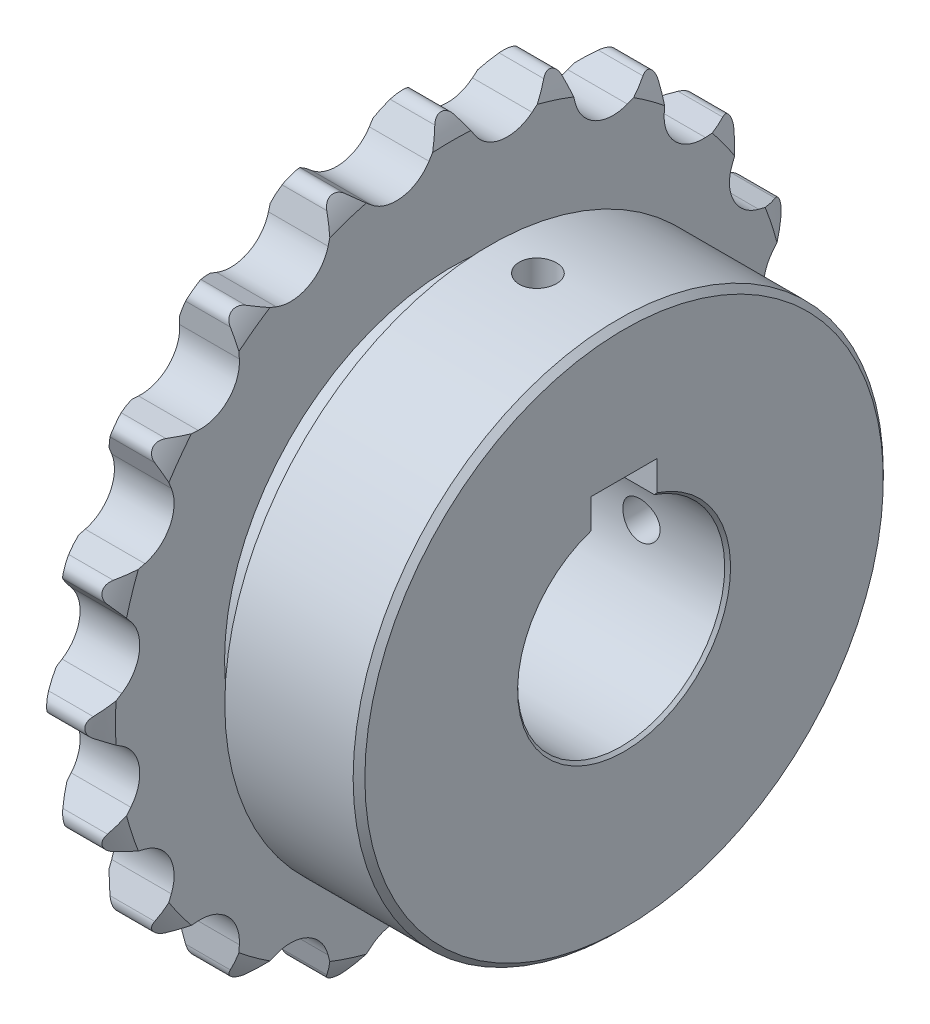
from build123d import *

# Parameters (mm, degrees)
SKIZZE2_R                       = 51.6
SCHNITT_LINEAR_AUSTRAGEN1_DEPTH = 7.2
SCHNITT_LINEAR_AUSTRAGEN2_DEPTH = 28
SKIZZE4_W                       = 2.25
SKIZZE4_H                       = 16.2
SKIZZE5_W                       = 2.25
SKIZZE5_H                       = 19.75


with BuildPart() as part:
    # Skizze1 → Rotation1 (revolve)
    with BuildSketch(Plane.XY, mode=Mode.PRIVATE) as rotation1_sk:
        with BuildLine():
            Line((0, 40.595), (0, 12.853553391))
            Line((0, 12.853553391), (0.353553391, 12.5))
            Line((0.353553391, 12.5), (27.646446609, 12.5))
            Line((27.646446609, 12.5), (28, 12.853553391))
            Line((28, 12.853553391), (28, 31.292893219))
            Line((28, 31.292893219), (27.292893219, 32))
            Line((27.292893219, 32), (11.8, 32))
            Line((11.8, 32), (11.8, 27.428571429))
            Line((11.8, 27.428571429), (7.2, 27.428571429))
            Line((7.2, 27.428571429), (7.2, 40.595))
            ThreePointArc((7.2, 40.595), (6.613396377, 41.831768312), (5.9, 43))
            Line((5.9, 43), (1.3, 43))
            ThreePointArc((1.3, 43), (0.586603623, 41.831768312), (0, 40.595))
        make_face()
    revolve(rotation1_sk.sketch.rotate(Axis((28, 0, 0), (-1, 0, 0)), 270), axis=Axis((28, 0, 0), (-1, 0, 0)))

    # Skizze2 → Schnitt-Linear austragen1 (cut)
    with BuildSketch(Plane(origin=(0, 0, 0), x_dir=(0, 0, -1), z_dir=(1, 0, 0))):
        Circle(SKIZZE2_R)
        with BuildLine():
            Line((-42.369627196, -1.145800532), (-39.839775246, -2.749089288))
            ThreePointArc((-39.839775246, -2.749089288), (-38.432356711, -4.13328118), (-37.719817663, -5.974232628))
            ThreePointArc((-37.719817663, -5.974232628), (-37.828597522, -7.945267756), (-38.739393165, -9.696628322))
            Line((-38.739393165, -9.696628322), (-40.649981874, -12.003213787))
            ThreePointArc((-40.649981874, -12.003213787), (-40.895430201, -13.287730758), (-39.941838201, -14.182655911))
            Line((-39.941838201, -14.182655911), (-37.040362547, -14.925706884))
            ThreePointArc((-37.040362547, -14.925706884), (-35.274089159, -15.807235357), (-34.027538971, -17.337897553))
            ThreePointArc((-34.027538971, -17.337897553), (-33.521911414, -19.246078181), (-33.846929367, -21.193172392))
            Line((-33.846929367, -21.193172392), (-34.951233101, -23.977269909))
            ThreePointArc((-34.951233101, -23.977269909), (-34.787730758, -25.274765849), (-33.604263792, -25.831214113))
            Line((-33.604263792, -25.831214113), (-30.615181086, -25.641292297))
            ThreePointArc((-30.615181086, -25.641292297), (-28.662947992, -25.933867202), (-27.004407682, -27.004408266))
            ThreePointArc((-27.004407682, -27.004408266), (-25.933867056, -28.662948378), (-25.641292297, -30.615181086))
            Line((-25.641292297, -30.615181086), (-25.831214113, -33.604263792))
            ThreePointArc((-25.831214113, -33.604263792), (-25.274765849, -34.787730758), (-23.977269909, -34.951233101))
            Line((-23.977269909, -34.951233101), (-21.193172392, -33.846929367))
            ThreePointArc((-21.193172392, -33.846929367), (-19.246077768, -33.521911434), (-17.337896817, -34.027539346))
            ThreePointArc((-17.337896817, -34.027539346), (-15.807235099, -35.274089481), (-14.925706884, -37.040362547))
            Line((-14.925706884, -37.040362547), (-14.182655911, -39.941838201))
            ThreePointArc((-14.182655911, -39.941838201), (-13.287730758, -40.895430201), (-12.003213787, -40.649981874))
            Line((-12.003213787, -40.649981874), (-9.696628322, -38.739393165))
            ThreePointArc((-9.696628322, -38.739393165), (-7.945267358, -37.828597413), (-5.974231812, -37.719817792))
            ThreePointArc((-5.974231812, -37.719817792), (-4.133280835, -38.432356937), (-2.749089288, -39.839775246))
            Line((-2.749089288, -39.839775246), (-1.145800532, -42.369627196))
            ThreePointArc((-1.145800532, -42.369627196), (0, -43), (1.145800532, -42.369627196))
            Line((1.145800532, -42.369627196), (2.749089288, -39.839775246))
            ThreePointArc((2.749089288, -39.839775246), (4.13328118, -38.432356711), (5.974232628, -37.719817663))
            ThreePointArc((5.974232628, -37.719817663), (7.945267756, -37.828597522), (9.696628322, -38.739393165))
            Line((9.696628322, -38.739393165), (12.003213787, -40.649981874))
            ThreePointArc((12.003213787, -40.649981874), (13.287730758, -40.895430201), (14.182655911, -39.941838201))
            Line((14.182655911, -39.941838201), (14.925706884, -37.040362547))
            ThreePointArc((14.925706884, -37.040362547), (15.807235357, -35.274089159), (17.337897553, -34.027538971))
            ThreePointArc((17.337897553, -34.027538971), (19.246078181, -33.521911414), (21.193172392, -33.846929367))
            Line((21.193172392, -33.846929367), (23.977269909, -34.951233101))
            ThreePointArc((23.977269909, -34.951233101), (25.274765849, -34.787730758), (25.831214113, -33.604263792))
            Line((25.831214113, -33.604263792), (25.641292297, -30.615181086))
            ThreePointArc((25.641292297, -30.615181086), (25.933867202, -28.662947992), (27.004408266, -27.004407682))
            ThreePointArc((27.004408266, -27.004407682), (28.662948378, -25.933867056), (30.615181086, -25.641292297))
            Line((30.615181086, -25.641292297), (33.604263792, -25.831214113))
            ThreePointArc((33.604263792, -25.831214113), (34.787730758, -25.274765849), (34.951233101, -23.977269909))
            Line((34.951233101, -23.977269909), (33.846929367, -21.193172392))
            ThreePointArc((33.846929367, -21.193172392), (33.521911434, -19.246077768), (34.027539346, -17.337896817))
            ThreePointArc((34.027539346, -17.337896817), (35.274089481, -15.807235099), (37.040362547, -14.925706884))
            Line((37.040362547, -14.925706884), (39.941838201, -14.182655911))
            ThreePointArc((39.941838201, -14.182655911), (40.895430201, -13.287730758), (40.649981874, -12.003213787))
            Line((40.649981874, -12.003213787), (38.739393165, -9.696628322))
            ThreePointArc((38.739393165, -9.696628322), (37.828597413, -7.945267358), (37.719817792, -5.974231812))
            ThreePointArc((37.719817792, -5.974231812), (38.432356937, -4.133280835), (39.839775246, -2.749089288))
            Line((39.839775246, -2.749089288), (42.369627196, -1.145800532))
            ThreePointArc((42.369627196, -1.145800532), (43, 0), (42.369627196, 1.145800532))
            Line((42.369627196, 1.145800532), (39.839775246, 2.749089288))
            ThreePointArc((39.839775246, 2.749089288), (38.432356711, 4.13328118), (37.719817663, 5.974232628))
            ThreePointArc((37.719817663, 5.974232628), (37.828597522, 7.945267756), (38.739393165, 9.696628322))
            Line((38.739393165, 9.696628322), (40.649981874, 12.003213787))
            ThreePointArc((40.649981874, 12.003213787), (40.895430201, 13.287730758), (39.941838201, 14.182655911))
            Line((39.941838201, 14.182655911), (37.040362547, 14.925706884))
            ThreePointArc((37.040362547, 14.925706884), (35.274089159, 15.807235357), (34.027538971, 17.337897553))
            ThreePointArc((34.027538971, 17.337897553), (33.521911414, 19.246078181), (33.846929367, 21.193172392))
            Line((33.846929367, 21.193172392), (34.951233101, 23.977269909))
            ThreePointArc((34.951233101, 23.977269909), (34.787730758, 25.274765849), (33.604263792, 25.831214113))
            Line((33.604263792, 25.831214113), (30.615181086, 25.641292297))
            ThreePointArc((30.615181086, 25.641292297), (28.662947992, 25.933867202), (27.004407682, 27.004408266))
            ThreePointArc((27.004407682, 27.004408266), (25.933867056, 28.662948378), (25.641292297, 30.615181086))
            Line((25.641292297, 30.615181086), (25.831214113, 33.604263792))
            ThreePointArc((25.831214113, 33.604263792), (25.274765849, 34.787730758), (23.977269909, 34.951233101))
            Line((23.977269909, 34.951233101), (21.193172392, 33.846929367))
            ThreePointArc((21.193172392, 33.846929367), (19.246077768, 33.521911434), (17.337896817, 34.027539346))
            ThreePointArc((17.337896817, 34.027539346), (15.807235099, 35.274089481), (14.925706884, 37.040362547))
            Line((14.925706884, 37.040362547), (14.182655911, 39.941838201))
            ThreePointArc((14.182655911, 39.941838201), (13.287730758, 40.895430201), (12.003213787, 40.649981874))
            Line((12.003213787, 40.649981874), (9.696628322, 38.739393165))
            ThreePointArc((9.696628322, 38.739393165), (7.945267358, 37.828597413), (5.974231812, 37.719817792))
            ThreePointArc((5.974231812, 37.719817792), (4.133280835, 38.432356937), (2.749089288, 39.839775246))
            Line((2.749089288, 39.839775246), (1.145800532, 42.369627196))
            ThreePointArc((1.145800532, 42.369627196), (0, 43), (-1.145800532, 42.369627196))
            Line((-1.145800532, 42.369627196), (-2.749089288, 39.839775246))
            ThreePointArc((-2.749089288, 39.839775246), (-4.13328118, 38.432356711), (-5.974232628, 37.719817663))
            ThreePointArc((-5.974232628, 37.719817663), (-7.945267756, 37.828597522), (-9.696628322, 38.739393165))
            Line((-9.696628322, 38.739393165), (-12.003213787, 40.649981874))
            ThreePointArc((-12.003213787, 40.649981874), (-13.287730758, 40.895430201), (-14.182655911, 39.941838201))
            Line((-14.182655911, 39.941838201), (-14.925706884, 37.040362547))
            ThreePointArc((-14.925706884, 37.040362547), (-15.807235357, 35.274089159), (-17.337897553, 34.027538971))
            ThreePointArc((-17.337897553, 34.027538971), (-19.246078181, 33.521911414), (-21.193172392, 33.846929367))
            Line((-21.193172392, 33.846929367), (-23.977269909, 34.951233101))
            ThreePointArc((-23.977269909, 34.951233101), (-25.274765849, 34.787730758), (-25.831214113, 33.604263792))
            Line((-25.831214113, 33.604263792), (-25.641292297, 30.615181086))
            ThreePointArc((-25.641292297, 30.615181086), (-25.933867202, 28.662947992), (-27.004408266, 27.004407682))
            ThreePointArc((-27.004408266, 27.004407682), (-28.662948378, 25.933867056), (-30.615181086, 25.641292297))
            Line((-30.615181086, 25.641292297), (-33.604263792, 25.831214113))
            ThreePointArc((-33.604263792, 25.831214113), (-34.787730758, 25.274765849), (-34.951233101, 23.977269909))
            Line((-34.951233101, 23.977269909), (-33.846929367, 21.193172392))
            ThreePointArc((-33.846929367, 21.193172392), (-33.521911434, 19.246077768), (-34.027539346, 17.337896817))
            ThreePointArc((-34.027539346, 17.337896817), (-35.274089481, 15.807235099), (-37.040362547, 14.925706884))
            Line((-37.040362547, 14.925706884), (-39.941838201, 14.182655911))
            ThreePointArc((-39.941838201, 14.182655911), (-40.895430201, 13.287730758), (-40.649981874, 12.003213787))
            Line((-40.649981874, 12.003213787), (-38.739393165, 9.696628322))
            ThreePointArc((-38.739393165, 9.696628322), (-37.828597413, 7.945267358), (-37.719817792, 5.974231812))
            ThreePointArc((-37.719817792, 5.974231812), (-38.432356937, 4.133280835), (-39.839775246, 2.749089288))
            Line((-39.839775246, 2.749089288), (-42.369627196, 1.145800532))
            ThreePointArc((-42.369627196, 1.145800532), (-43, 0), (-42.369627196, -1.145800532))
        make_face(mode=Mode.SUBTRACT)
    extrude(amount=SCHNITT_LINEAR_AUSTRAGEN1_DEPTH, mode=Mode.SUBTRACT)

    # Skizze3 → Schnitt-Linear austragen2 (cut)
    with BuildSketch(Plane(origin=(28, 0, 0), x_dir=(0, 0, -1), z_dir=(1, 0, 0))):
        with BuildLine():
            Line((4, 11.842719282), (4, 15.8))
            Line((4, 15.8), (-4, 15.8))
            Line((-4, 15.8), (-4, 11.842719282))
            ThreePointArc((-4, 11.842719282), (0, -12.5), (4, 11.842719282))
        make_face()
    extrude(amount=-SCHNITT_LINEAR_AUSTRAGEN2_DEPTH, mode=Mode.SUBTRACT)

    # Skizze4 → Schnitt-Rotation1 (revolve, cut)
    with BuildSketch(Plane.XY, mode=Mode.PRIVATE) as schnitt_rotation1_sk:
        with Locations((18.725, 23.9)):
            Rectangle(SKIZZE4_W, SKIZZE4_H)
    revolve(schnitt_rotation1_sk.sketch.rotate(Axis((17.6, 15.8, 0), (0, 1, 0)), 270), axis=Axis((17.6, 15.8, 0), (0, 1, 0)), mode=Mode.SUBTRACT)

    # Skizze5 → Schnitt-Rotation2 (revolve, cut)
    with BuildSketch(Plane(origin=(0, 0, 0), x_dir=(-1, 0, 0), z_dir=(0, 1, 0)), mode=Mode.PRIVATE) as schnitt_rotation2_sk:
        with Locations((-18.725, -22.125)):
            Rectangle(SKIZZE5_W, SKIZZE5_H)
    revolve(schnitt_rotation2_sk.sketch.rotate(Axis((17.6, 0, -12.25), (0, 0, -1)), 180), axis=Axis((17.6, 0, -12.25), (0, 0, -1)), mode=Mode.SUBTRACT)


solid = part.part
